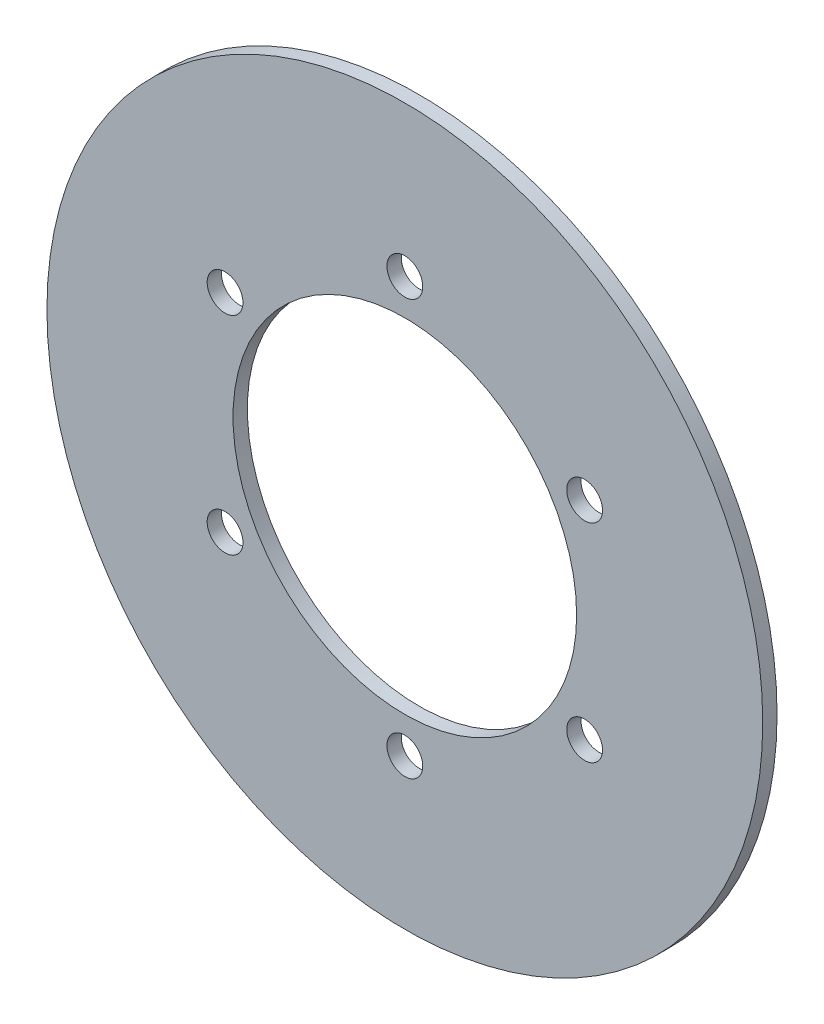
ISO-10303-21;
HEADER;
FILE_DESCRIPTION(('STEP AP214'),'2;1');
FILE_NAME('part.step','',(''),(''),'','','');
FILE_SCHEMA(('AUTOMOTIVE_DESIGN { 1 0 10303 214 1 1 1 1 }'));
ENDSEC;
DATA;
#1=APPLICATION_CONTEXT('core data for automotive mechanical design processes');
#2=APPLICATION_PROTOCOL_DEFINITION('international standard','automotive_design',2000,#1);
#3=PRODUCT_CONTEXT('',#1,'mechanical');
#4=PRODUCT('Part','Part','',(#3));
#5=PRODUCT_RELATED_PRODUCT_CATEGORY('part','',(#4));
#6=PRODUCT_DEFINITION_FORMATION('','',#4);
#7=PRODUCT_DEFINITION_CONTEXT('part definition',#1,'design');
#8=PRODUCT_DEFINITION('design','',#6,#7);
#9=PRODUCT_DEFINITION_SHAPE('','',#8);
#10=(LENGTH_UNIT() NAMED_UNIT(*) SI_UNIT(.MILLI.,.METRE.));
#11=(NAMED_UNIT(*) PLANE_ANGLE_UNIT() SI_UNIT($,.RADIAN.));
#12=(NAMED_UNIT(*) SI_UNIT($,.STERADIAN.) SOLID_ANGLE_UNIT());
#13=UNCERTAINTY_MEASURE_WITH_UNIT(LENGTH_MEASURE(1.E-05),#10,'distance_accuracy_value','');
#14=(GEOMETRIC_REPRESENTATION_CONTEXT(3) GLOBAL_UNCERTAINTY_ASSIGNED_CONTEXT((#13)) GLOBAL_UNIT_ASSIGNED_CONTEXT((#10,
#11,#12)) REPRESENTATION_CONTEXT('',''));
#15=CARTESIAN_POINT('',(0.,0.,0.));
#16=DIRECTION('',(0.,0.,1.));
#17=DIRECTION('',(1.,0.,0.));
#18=AXIS2_PLACEMENT_3D('',#15,#16,#17);
#19=CARTESIAN_POINT('',(0.,0.,2.));
#20=DIRECTION('',(0.,0.,1.));
#21=DIRECTION('',(1.,0.,0.));
#22=AXIS2_PLACEMENT_3D('',#19,#20,#21);
#23=PLANE('',#22);
#24=CARTESIAN_POINT('',(-25.1147367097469,-14.5000000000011,2.));
#25=DIRECTION('',(0.,0.,1.));
#26=DIRECTION('',(1.,0.,0.));
#27=AXIS2_PLACEMENT_3D('',#24,#25,#26);
#28=CIRCLE('',#27,2.50000000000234);
#29=CARTESIAN_POINT('',(-22.6147367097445,-14.5000000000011,2.));
#30=VERTEX_POINT('',#29);
#31=EDGE_CURVE('E88',#30,#30,#28,.T.);
#32=ORIENTED_EDGE('',*,*,#31,.F.);
#33=EDGE_LOOP('',(#32));
#34=FACE_BOUND('',#33,.T.);
#35=CARTESIAN_POINT('',(25.1147367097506,-14.4999999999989,2.));
#36=DIRECTION('',(0.,0.,1.));
#37=DIRECTION('',(1.,0.,0.));
#38=AXIS2_PLACEMENT_3D('',#35,#36,#37);
#39=CIRCLE('',#38,2.50000000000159);
#40=CARTESIAN_POINT('',(27.6147367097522,-14.4999999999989,2.));
#41=VERTEX_POINT('',#40);
#42=EDGE_CURVE('E72',#41,#41,#39,.T.);
#43=ORIENTED_EDGE('',*,*,#42,.F.);
#44=EDGE_LOOP('',(#43));
#45=FACE_BOUND('',#44,.T.);
#46=CARTESIAN_POINT('',(0.,29.,2.));
#47=DIRECTION('',(0.,0.,1.));
#48=DIRECTION('',(1.,0.,0.));
#49=AXIS2_PLACEMENT_3D('',#46,#47,#48);
#50=CIRCLE('',#49,2.5);
#51=CARTESIAN_POINT('',(2.5,29.,2.));
#52=VERTEX_POINT('',#51);
#53=EDGE_CURVE('E56',#52,#52,#50,.T.);
#54=ORIENTED_EDGE('',*,*,#53,.F.);
#55=EDGE_LOOP('',(#54));
#56=FACE_BOUND('',#55,.T.);
#57=CARTESIAN_POINT('',(0.,0.,2.));
#58=DIRECTION('',(0.,0.,1.));
#59=DIRECTION('',(1.,0.,0.));
#60=AXIS2_PLACEMENT_3D('',#57,#58,#59);
#61=CIRCLE('',#60,50.);
#62=CARTESIAN_POINT('',(50.,0.,2.));
#63=VERTEX_POINT('',#62);
#64=EDGE_CURVE('E10',#63,#63,#61,.T.);
#65=ORIENTED_EDGE('',*,*,#64,.T.);
#66=EDGE_LOOP('',(#65));
#67=FACE_BOUND('',#66,.T.);
#68=CARTESIAN_POINT('',(0.,0.,2.));
#69=DIRECTION('',(0.,0.,1.));
#70=DIRECTION('',(1.,0.,0.));
#71=AXIS2_PLACEMENT_3D('',#68,#69,#70);
#72=CIRCLE('',#71,24.);
#73=CARTESIAN_POINT('',(24.,0.,2.));
#74=VERTEX_POINT('',#73);
#75=EDGE_CURVE('E50',#74,#74,#72,.T.);
#76=ORIENTED_EDGE('',*,*,#75,.F.);
#77=EDGE_LOOP('',(#76));
#78=FACE_BOUND('',#77,.T.);
#79=CARTESIAN_POINT('',(25.1147367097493,14.5000000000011,2.));
#80=DIRECTION('',(0.,0.,1.));
#81=DIRECTION('',(1.,0.,0.));
#82=AXIS2_PLACEMENT_3D('',#79,#80,#81);
#83=CIRCLE('',#82,2.50000000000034);
#84=CARTESIAN_POINT('',(27.6147367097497,14.5000000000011,2.));
#85=VERTEX_POINT('',#84);
#86=EDGE_CURVE('E64',#85,#85,#83,.T.);
#87=ORIENTED_EDGE('',*,*,#86,.F.);
#88=EDGE_LOOP('',(#87));
#89=FACE_BOUND('',#88,.T.);
#90=CARTESIAN_POINT('',(2.46203429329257E-12,-29.,2.));
#91=DIRECTION('',(0.,0.,1.));
#92=DIRECTION('',(1.,0.,0.));
#93=AXIS2_PLACEMENT_3D('',#90,#91,#92);
#94=CIRCLE('',#93,2.50000000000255);
#95=CARTESIAN_POINT('',(2.50000000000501,-29.,2.));
#96=VERTEX_POINT('',#95);
#97=EDGE_CURVE('E80',#96,#96,#94,.T.);
#98=ORIENTED_EDGE('',*,*,#97,.F.);
#99=EDGE_LOOP('',(#98));
#100=FACE_BOUND('',#99,.T.);
#101=CARTESIAN_POINT('',(-25.1147367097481,14.4999999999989,2.));
#102=DIRECTION('',(0.,0.,1.));
#103=DIRECTION('',(1.,0.,0.));
#104=AXIS2_PLACEMENT_3D('',#101,#102,#103);
#105=CIRCLE('',#104,2.50000000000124);
#106=CARTESIAN_POINT('',(-22.6147367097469,14.4999999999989,2.));
#107=VERTEX_POINT('',#106);
#108=EDGE_CURVE('E96',#107,#107,#105,.T.);
#109=ORIENTED_EDGE('',*,*,#108,.F.);
#110=EDGE_LOOP('',(#109));
#111=FACE_BOUND('',#110,.T.);
#112=ADVANCED_FACE('F37',(#34,#45,#56,#67,#78,#89,#100,#111),#23,.T.);
#113=CARTESIAN_POINT('',(0.,0.,0.));
#114=DIRECTION('',(0.,0.,1.));
#115=DIRECTION('',(1.,0.,0.));
#116=AXIS2_PLACEMENT_3D('',#113,#114,#115);
#117=PLANE('',#116);
#118=CARTESIAN_POINT('',(0.,0.,0.));
#119=DIRECTION('',(0.,0.,1.));
#120=DIRECTION('',(1.,0.,0.));
#121=AXIS2_PLACEMENT_3D('',#118,#119,#120);
#122=CIRCLE('',#121,50.);
#123=CARTESIAN_POINT('',(50.,0.,0.));
#124=VERTEX_POINT('',#123);
#125=EDGE_CURVE('E41',#124,#124,#122,.T.);
#126=ORIENTED_EDGE('',*,*,#125,.F.);
#127=EDGE_LOOP('',(#126));
#128=FACE_BOUND('',#127,.T.);
#129=CARTESIAN_POINT('',(0.,0.,0.));
#130=DIRECTION('',(0.,0.,1.));
#131=DIRECTION('',(1.,0.,0.));
#132=AXIS2_PLACEMENT_3D('',#129,#130,#131);
#133=CIRCLE('',#132,24.);
#134=CARTESIAN_POINT('',(24.,0.,0.));
#135=VERTEX_POINT('',#134);
#136=EDGE_CURVE('E52',#135,#135,#133,.T.);
#137=ORIENTED_EDGE('',*,*,#136,.T.);
#138=EDGE_LOOP('',(#137));
#139=FACE_BOUND('',#138,.T.);
#140=CARTESIAN_POINT('',(0.,29.,0.));
#141=DIRECTION('',(0.,0.,1.));
#142=DIRECTION('',(1.,0.,0.));
#143=AXIS2_PLACEMENT_3D('',#140,#141,#142);
#144=CIRCLE('',#143,2.5);
#145=CARTESIAN_POINT('',(2.5,29.,0.));
#146=VERTEX_POINT('',#145);
#147=EDGE_CURVE('E60',#146,#146,#144,.T.);
#148=ORIENTED_EDGE('',*,*,#147,.T.);
#149=EDGE_LOOP('',(#148));
#150=FACE_BOUND('',#149,.T.);
#151=CARTESIAN_POINT('',(25.1147367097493,14.5000000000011,0.));
#152=DIRECTION('',(0.,0.,1.));
#153=DIRECTION('',(1.,0.,0.));
#154=AXIS2_PLACEMENT_3D('',#151,#152,#153);
#155=CIRCLE('',#154,2.50000000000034);
#156=CARTESIAN_POINT('',(27.6147367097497,14.5000000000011,0.));
#157=VERTEX_POINT('',#156);
#158=EDGE_CURVE('E68',#157,#157,#155,.T.);
#159=ORIENTED_EDGE('',*,*,#158,.T.);
#160=EDGE_LOOP('',(#159));
#161=FACE_BOUND('',#160,.T.);
#162=CARTESIAN_POINT('',(25.1147367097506,-14.4999999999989,0.));
#163=DIRECTION('',(0.,0.,1.));
#164=DIRECTION('',(1.,0.,0.));
#165=AXIS2_PLACEMENT_3D('',#162,#163,#164);
#166=CIRCLE('',#165,2.50000000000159);
#167=CARTESIAN_POINT('',(27.6147367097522,-14.4999999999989,0.));
#168=VERTEX_POINT('',#167);
#169=EDGE_CURVE('E76',#168,#168,#166,.T.);
#170=ORIENTED_EDGE('',*,*,#169,.T.);
#171=EDGE_LOOP('',(#170));
#172=FACE_BOUND('',#171,.T.);
#173=CARTESIAN_POINT('',(2.46203429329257E-12,-29.,0.));
#174=DIRECTION('',(0.,0.,1.));
#175=DIRECTION('',(1.,0.,0.));
#176=AXIS2_PLACEMENT_3D('',#173,#174,#175);
#177=CIRCLE('',#176,2.50000000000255);
#178=CARTESIAN_POINT('',(2.50000000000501,-29.,0.));
#179=VERTEX_POINT('',#178);
#180=EDGE_CURVE('E84',#179,#179,#177,.T.);
#181=ORIENTED_EDGE('',*,*,#180,.T.);
#182=EDGE_LOOP('',(#181));
#183=FACE_BOUND('',#182,.T.);
#184=CARTESIAN_POINT('',(-25.1147367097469,-14.5000000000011,0.));
#185=DIRECTION('',(0.,0.,1.));
#186=DIRECTION('',(1.,0.,0.));
#187=AXIS2_PLACEMENT_3D('',#184,#185,#186);
#188=CIRCLE('',#187,2.50000000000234);
#189=CARTESIAN_POINT('',(-22.6147367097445,-14.5000000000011,0.));
#190=VERTEX_POINT('',#189);
#191=EDGE_CURVE('E92',#190,#190,#188,.T.);
#192=ORIENTED_EDGE('',*,*,#191,.T.);
#193=EDGE_LOOP('',(#192));
#194=FACE_BOUND('',#193,.T.);
#195=CARTESIAN_POINT('',(-25.1147367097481,14.4999999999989,0.));
#196=DIRECTION('',(0.,0.,1.));
#197=DIRECTION('',(1.,0.,0.));
#198=AXIS2_PLACEMENT_3D('',#195,#196,#197);
#199=CIRCLE('',#198,2.50000000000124);
#200=CARTESIAN_POINT('',(-22.6147367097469,14.4999999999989,0.));
#201=VERTEX_POINT('',#200);
#202=EDGE_CURVE('E100',#201,#201,#199,.T.);
#203=ORIENTED_EDGE('',*,*,#202,.T.);
#204=EDGE_LOOP('',(#203));
#205=FACE_BOUND('',#204,.T.);
#206=ADVANCED_FACE('F112',(#128,#139,#150,#161,#172,#183,#194,#205),#117,.F.);
#207=CARTESIAN_POINT('',(0.,0.,2.));
#208=DIRECTION('',(0.,0.,-1.));
#209=DIRECTION('',(-1.,0.,0.));
#210=AXIS2_PLACEMENT_3D('',#207,#208,#209);
#211=CYLINDRICAL_SURFACE('',#210,50.);
#212=ORIENTED_EDGE('',*,*,#64,.F.);
#213=EDGE_LOOP('',(#212));
#214=FACE_BOUND('',#213,.T.);
#215=ORIENTED_EDGE('',*,*,#125,.T.);
#216=EDGE_LOOP('',(#215));
#217=FACE_BOUND('',#216,.T.);
#218=ADVANCED_FACE('F39',(#214,#217),#211,.T.);
#219=CARTESIAN_POINT('',(0.,0.,2.));
#220=DIRECTION('',(0.,0.,-1.));
#221=DIRECTION('',(-1.,0.,0.));
#222=AXIS2_PLACEMENT_3D('',#219,#220,#221);
#223=CYLINDRICAL_SURFACE('',#222,24.);
#224=ORIENTED_EDGE('',*,*,#75,.T.);
#225=EDGE_LOOP('',(#224));
#226=FACE_BOUND('',#225,.T.);
#227=ORIENTED_EDGE('',*,*,#136,.F.);
#228=EDGE_LOOP('',(#227));
#229=FACE_BOUND('',#228,.T.);
#230=ADVANCED_FACE('F122',(#226,#229),#223,.F.);
#231=CARTESIAN_POINT('',(0.,29.,2.));
#232=DIRECTION('',(0.,0.,-1.));
#233=DIRECTION('',(-1.,0.,0.));
#234=AXIS2_PLACEMENT_3D('',#231,#232,#233);
#235=CYLINDRICAL_SURFACE('',#234,2.5);
#236=ORIENTED_EDGE('',*,*,#53,.T.);
#237=EDGE_LOOP('',(#236));
#238=FACE_BOUND('',#237,.T.);
#239=ORIENTED_EDGE('',*,*,#147,.F.);
#240=EDGE_LOOP('',(#239));
#241=FACE_BOUND('',#240,.T.);
#242=ADVANCED_FACE('F125',(#238,#241),#235,.F.);
#243=CARTESIAN_POINT('',(25.1147367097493,14.5000000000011,2.));
#244=DIRECTION('',(0.,0.,-1.));
#245=DIRECTION('',(-1.,0.,0.));
#246=AXIS2_PLACEMENT_3D('',#243,#244,#245);
#247=CYLINDRICAL_SURFACE('',#246,2.50000000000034);
#248=ORIENTED_EDGE('',*,*,#86,.T.);
#249=EDGE_LOOP('',(#248));
#250=FACE_BOUND('',#249,.T.);
#251=ORIENTED_EDGE('',*,*,#158,.F.);
#252=EDGE_LOOP('',(#251));
#253=FACE_BOUND('',#252,.T.);
#254=ADVANCED_FACE('F129',(#250,#253),#247,.F.);
#255=CARTESIAN_POINT('',(25.1147367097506,-14.4999999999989,2.));
#256=DIRECTION('',(0.,0.,-1.));
#257=DIRECTION('',(-1.,0.,0.));
#258=AXIS2_PLACEMENT_3D('',#255,#256,#257);
#259=CYLINDRICAL_SURFACE('',#258,2.50000000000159);
#260=ORIENTED_EDGE('',*,*,#42,.T.);
#261=EDGE_LOOP('',(#260));
#262=FACE_BOUND('',#261,.T.);
#263=ORIENTED_EDGE('',*,*,#169,.F.);
#264=EDGE_LOOP('',(#263));
#265=FACE_BOUND('',#264,.T.);
#266=ADVANCED_FACE('F133',(#262,#265),#259,.F.);
#267=CARTESIAN_POINT('',(2.46203429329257E-12,-29.,2.));
#268=DIRECTION('',(0.,0.,-1.));
#269=DIRECTION('',(-1.,0.,0.));
#270=AXIS2_PLACEMENT_3D('',#267,#268,#269);
#271=CYLINDRICAL_SURFACE('',#270,2.50000000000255);
#272=ORIENTED_EDGE('',*,*,#97,.T.);
#273=EDGE_LOOP('',(#272));
#274=FACE_BOUND('',#273,.T.);
#275=ORIENTED_EDGE('',*,*,#180,.F.);
#276=EDGE_LOOP('',(#275));
#277=FACE_BOUND('',#276,.T.);
#278=ADVANCED_FACE('F137',(#274,#277),#271,.F.);
#279=CARTESIAN_POINT('',(-25.1147367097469,-14.5000000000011,2.));
#280=DIRECTION('',(0.,0.,-1.));
#281=DIRECTION('',(-1.,0.,0.));
#282=AXIS2_PLACEMENT_3D('',#279,#280,#281);
#283=CYLINDRICAL_SURFACE('',#282,2.50000000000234);
#284=ORIENTED_EDGE('',*,*,#31,.T.);
#285=EDGE_LOOP('',(#284));
#286=FACE_BOUND('',#285,.T.);
#287=ORIENTED_EDGE('',*,*,#191,.F.);
#288=EDGE_LOOP('',(#287));
#289=FACE_BOUND('',#288,.T.);
#290=ADVANCED_FACE('F141',(#286,#289),#283,.F.);
#291=CARTESIAN_POINT('',(-25.1147367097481,14.4999999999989,2.));
#292=DIRECTION('',(0.,0.,-1.));
#293=DIRECTION('',(-1.,0.,0.));
#294=AXIS2_PLACEMENT_3D('',#291,#292,#293);
#295=CYLINDRICAL_SURFACE('',#294,2.50000000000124);
#296=ORIENTED_EDGE('',*,*,#108,.T.);
#297=EDGE_LOOP('',(#296));
#298=FACE_BOUND('',#297,.T.);
#299=ORIENTED_EDGE('',*,*,#202,.F.);
#300=EDGE_LOOP('',(#299));
#301=FACE_BOUND('',#300,.T.);
#302=ADVANCED_FACE('F108',(#298,#301),#295,.F.);
#303=CLOSED_SHELL('',(#112,#206,#218,#230,#242,#254,#266,#278,#290,#302));
#304=MANIFOLD_SOLID_BREP('B2',#303);
#305=ADVANCED_BREP_SHAPE_REPRESENTATION('',(#18,#304),#14);
#306=SHAPE_DEFINITION_REPRESENTATION(#9,#305);
ENDSEC;
END-ISO-10303-21;
